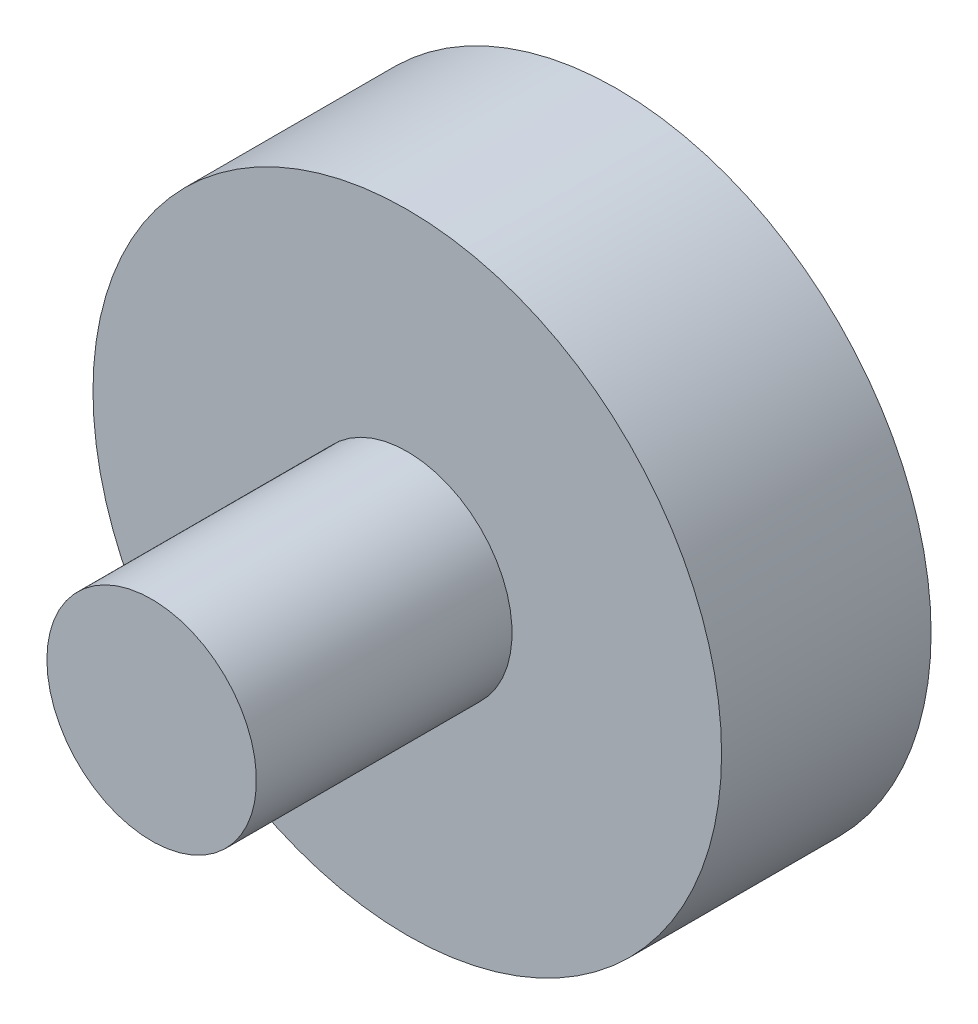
ISO-10303-21;
HEADER;
FILE_DESCRIPTION(('STEP AP214'),'2;1');
FILE_NAME('part.step','',(''),(''),'','','');
FILE_SCHEMA(('AUTOMOTIVE_DESIGN { 1 0 10303 214 1 1 1 1 }'));
ENDSEC;
DATA;
#1=APPLICATION_CONTEXT('core data for automotive mechanical design processes');
#2=APPLICATION_PROTOCOL_DEFINITION('international standard','automotive_design',2000,#1);
#3=PRODUCT_CONTEXT('',#1,'mechanical');
#4=PRODUCT('Part','Part','',(#3));
#5=PRODUCT_RELATED_PRODUCT_CATEGORY('part','',(#4));
#6=PRODUCT_DEFINITION_FORMATION('','',#4);
#7=PRODUCT_DEFINITION_CONTEXT('part definition',#1,'design');
#8=PRODUCT_DEFINITION('design','',#6,#7);
#9=PRODUCT_DEFINITION_SHAPE('','',#8);
#10=(LENGTH_UNIT() NAMED_UNIT(*) SI_UNIT(.MILLI.,.METRE.));
#11=(NAMED_UNIT(*) PLANE_ANGLE_UNIT() SI_UNIT($,.RADIAN.));
#12=(NAMED_UNIT(*) SI_UNIT($,.STERADIAN.) SOLID_ANGLE_UNIT());
#13=UNCERTAINTY_MEASURE_WITH_UNIT(LENGTH_MEASURE(1.E-05),#10,'distance_accuracy_value','');
#14=(GEOMETRIC_REPRESENTATION_CONTEXT(3) GLOBAL_UNCERTAINTY_ASSIGNED_CONTEXT((#13)) GLOBAL_UNIT_ASSIGNED_CONTEXT((#10,
#11,#12)) REPRESENTATION_CONTEXT('',''));
#15=CARTESIAN_POINT('',(0.,0.,0.));
#16=DIRECTION('',(0.,0.,1.));
#17=DIRECTION('',(1.,0.,0.));
#18=AXIS2_PLACEMENT_3D('',#15,#16,#17);
#19=CARTESIAN_POINT('',(0.,0.,50.));
#20=DIRECTION('',(0.,0.,-1.));
#21=DIRECTION('',(-1.,0.,0.));
#22=AXIS2_PLACEMENT_3D('',#19,#20,#21);
#23=CYLINDRICAL_SURFACE('',#22,75.);
#24=CARTESIAN_POINT('',(0.,0.,50.));
#25=DIRECTION('',(0.,0.,1.));
#26=DIRECTION('',(1.,0.,0.));
#27=AXIS2_PLACEMENT_3D('',#24,#25,#26);
#28=CIRCLE('',#27,75.);
#29=CARTESIAN_POINT('',(75.,0.,50.));
#30=VERTEX_POINT('',#29);
#31=EDGE_CURVE('E52',#30,#30,#28,.T.);
#32=ORIENTED_EDGE('',*,*,#31,.F.);
#33=EDGE_LOOP('',(#32));
#34=FACE_BOUND('',#33,.T.);
#35=CARTESIAN_POINT('',(0.,0.,0.));
#36=DIRECTION('',(0.,0.,1.));
#37=DIRECTION('',(1.,0.,0.));
#38=AXIS2_PLACEMENT_3D('',#35,#36,#37);
#39=CIRCLE('',#38,75.);
#40=CARTESIAN_POINT('',(75.,0.,0.));
#41=VERTEX_POINT('',#40);
#42=EDGE_CURVE('E48',#41,#41,#39,.T.);
#43=ORIENTED_EDGE('',*,*,#42,.T.);
#44=EDGE_LOOP('',(#43));
#45=FACE_BOUND('',#44,.T.);
#46=ADVANCED_FACE('F45',(#34,#45),#23,.T.);
#47=CARTESIAN_POINT('',(0.,0.,50.));
#48=DIRECTION('',(0.,0.,1.));
#49=DIRECTION('',(1.,0.,0.));
#50=AXIS2_PLACEMENT_3D('',#47,#48,#49);
#51=PLANE('',#50);
#52=CARTESIAN_POINT('',(0.,0.,50.));
#53=DIRECTION('',(0.,0.,1.));
#54=DIRECTION('',(1.,0.,0.));
#55=AXIS2_PLACEMENT_3D('',#52,#53,#54);
#56=CIRCLE('',#55,25.);
#57=CARTESIAN_POINT('',(-25.,0.,50.));
#58=VERTEX_POINT('',#57);
#59=EDGE_CURVE('E10',#58,#58,#56,.T.);
#60=ORIENTED_EDGE('',*,*,#59,.F.);
#61=EDGE_LOOP('',(#60));
#62=FACE_BOUND('',#61,.T.);
#63=ORIENTED_EDGE('',*,*,#31,.T.);
#64=EDGE_LOOP('',(#63));
#65=FACE_BOUND('',#64,.T.);
#66=ADVANCED_FACE('F69',(#62,#65),#51,.T.);
#67=CARTESIAN_POINT('',(0.,0.,0.));
#68=DIRECTION('',(0.,0.,1.));
#69=DIRECTION('',(1.,0.,0.));
#70=AXIS2_PLACEMENT_3D('',#67,#68,#69);
#71=PLANE('',#70);
#72=ORIENTED_EDGE('',*,*,#42,.F.);
#73=EDGE_LOOP('',(#72));
#74=FACE_BOUND('',#73,.T.);
#75=ADVANCED_FACE('F66',(#74),#71,.F.);
#76=CARTESIAN_POINT('',(0.,0.,111.));
#77=DIRECTION('',(0.,0.,-1.));
#78=DIRECTION('',(-1.,0.,0.));
#79=AXIS2_PLACEMENT_3D('',#76,#77,#78);
#80=CYLINDRICAL_SURFACE('',#79,25.);
#81=CARTESIAN_POINT('',(0.,0.,111.));
#82=DIRECTION('',(0.,0.,1.));
#83=DIRECTION('',(1.,0.,0.));
#84=AXIS2_PLACEMENT_3D('',#81,#82,#83);
#85=CIRCLE('',#84,25.);
#86=CARTESIAN_POINT('',(-25.,0.,111.));
#87=VERTEX_POINT('',#86);
#88=EDGE_CURVE('E58',#87,#87,#85,.T.);
#89=CARTESIAN_POINT('',(-25.,0.,111.));
#90=CARTESIAN_POINT('',(-25.,0.,110.364583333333));
#91=CARTESIAN_POINT('',(-25.,0.,109.729166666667));
#92=CARTESIAN_POINT('',(-25.,0.,108.458333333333));
#93=CARTESIAN_POINT('',(-25.,0.,107.822916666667));
#94=CARTESIAN_POINT('',(-25.,0.,106.552083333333));
#95=CARTESIAN_POINT('',(-25.,0.,105.916666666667));
#96=CARTESIAN_POINT('',(-25.,0.,104.645833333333));
#97=CARTESIAN_POINT('',(-25.,0.,104.010416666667));
#98=CARTESIAN_POINT('',(-25.,0.,102.739583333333));
#99=CARTESIAN_POINT('',(-25.,0.,102.104166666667));
#100=CARTESIAN_POINT('',(-25.,0.,100.833333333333));
#101=CARTESIAN_POINT('',(-25.,0.,100.197916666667));
#102=CARTESIAN_POINT('',(-25.,0.,98.9270833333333));
#103=CARTESIAN_POINT('',(-25.,0.,98.2916666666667));
#104=CARTESIAN_POINT('',(-25.,0.,97.0208333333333));
#105=CARTESIAN_POINT('',(-25.,0.,96.3854166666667));
#106=CARTESIAN_POINT('',(-25.,0.,95.1145833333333));
#107=CARTESIAN_POINT('',(-25.,0.,94.4791666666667));
#108=CARTESIAN_POINT('',(-25.,0.,93.2083333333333));
#109=CARTESIAN_POINT('',(-25.,0.,92.5729166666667));
#110=CARTESIAN_POINT('',(-25.,0.,91.3020833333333));
#111=CARTESIAN_POINT('',(-25.,0.,90.6666666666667));
#112=CARTESIAN_POINT('',(-25.,0.,89.3958333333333));
#113=CARTESIAN_POINT('',(-25.,0.,88.7604166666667));
#114=CARTESIAN_POINT('',(-25.,0.,87.4895833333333));
#115=CARTESIAN_POINT('',(-25.,0.,86.8541666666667));
#116=CARTESIAN_POINT('',(-25.,0.,85.5833333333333));
#117=CARTESIAN_POINT('',(-25.,0.,84.9479166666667));
#118=CARTESIAN_POINT('',(-25.,0.,83.6770833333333));
#119=CARTESIAN_POINT('',(-25.,0.,83.0416666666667));
#120=CARTESIAN_POINT('',(-25.,0.,81.7708333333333));
#121=CARTESIAN_POINT('',(-25.,0.,81.1354166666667));
#122=CARTESIAN_POINT('',(-25.,0.,79.8645833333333));
#123=CARTESIAN_POINT('',(-25.,0.,79.2291666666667));
#124=CARTESIAN_POINT('',(-25.,0.,77.9583333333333));
#125=CARTESIAN_POINT('',(-25.,0.,77.3229166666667));
#126=CARTESIAN_POINT('',(-25.,0.,76.0520833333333));
#127=CARTESIAN_POINT('',(-25.,0.,75.4166666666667));
#128=CARTESIAN_POINT('',(-25.,0.,74.1458333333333));
#129=CARTESIAN_POINT('',(-25.,0.,73.5104166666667));
#130=CARTESIAN_POINT('',(-25.,0.,72.2395833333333));
#131=CARTESIAN_POINT('',(-25.,0.,71.6041666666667));
#132=CARTESIAN_POINT('',(-25.,0.,70.3333333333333));
#133=CARTESIAN_POINT('',(-25.,0.,69.6979166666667));
#134=CARTESIAN_POINT('',(-25.,0.,68.4270833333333));
#135=CARTESIAN_POINT('',(-25.,0.,67.7916666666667));
#136=CARTESIAN_POINT('',(-25.,0.,66.5208333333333));
#137=CARTESIAN_POINT('',(-25.,0.,65.8854166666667));
#138=CARTESIAN_POINT('',(-25.,0.,64.6145833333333));
#139=CARTESIAN_POINT('',(-25.,0.,63.9791666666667));
#140=CARTESIAN_POINT('',(-25.,0.,62.7083333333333));
#141=CARTESIAN_POINT('',(-25.,0.,62.0729166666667));
#142=CARTESIAN_POINT('',(-25.,0.,60.8020833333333));
#143=CARTESIAN_POINT('',(-25.,0.,60.1666666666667));
#144=CARTESIAN_POINT('',(-25.,0.,58.8958333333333));
#145=CARTESIAN_POINT('',(-25.,0.,58.2604166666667));
#146=CARTESIAN_POINT('',(-25.,0.,56.9895833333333));
#147=CARTESIAN_POINT('',(-25.,0.,56.3541666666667));
#148=CARTESIAN_POINT('',(-25.,0.,55.0833333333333));
#149=CARTESIAN_POINT('',(-25.,0.,54.4479166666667));
#150=CARTESIAN_POINT('',(-25.,0.,53.1770833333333));
#151=CARTESIAN_POINT('',(-25.,0.,52.5416666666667));
#152=CARTESIAN_POINT('',(-25.,0.,51.2708333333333));
#153=CARTESIAN_POINT('',(-25.,0.,50.6354166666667));
#154=CARTESIAN_POINT('',(-25.,0.,50.));
#155=B_SPLINE_CURVE_WITH_KNOTS('',3,(#89,#90,#91,#92,#93,#94,#95,#96,#97,#98,#99,#100,#101,#102,
#103,#104,#105,#106,#107,#108,#109,#110,#111,#112,#113,#114,#115,#116,#117,#118,#119,#120,#121,
#122,#123,#124,#125,#126,#127,#128,#129,#130,#131,#132,#133,#134,#135,#136,#137,#138,#139,#140,
#141,#142,#143,#144,#145,#146,#147,#148,#149,#150,#151,#152,#153,#154),.UNSPECIFIED.,.F.,.F.,(4,
2,2,2,2,2,2,2,2,2,2,2,2,2,2,2,2,2,2,2,2,2,2,2,2,2,2,2,2,2,2,2,4),(0.,1.90625,3.8125,
5.71874999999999,7.62499999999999,9.53124999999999,11.4375,13.34375,15.25,17.15625,19.0625,
20.96875,22.875,24.78125,26.6875,28.59375,30.5,32.40625,34.3125,36.21875,38.125,40.03125,
41.9375,43.84375,45.75,47.65625,49.5625,51.46875,53.375,55.28125,57.1875,59.09375,61.),.UNSPECIFIED.);
#156=EDGE_CURVE('BSEAM68',#87,#58,#155,.T.);
#157=ORIENTED_EDGE('',*,*,#88,.F.);
#158=ORIENTED_EDGE('',*,*,#59,.T.);
#159=ORIENTED_EDGE('',*,*,#156,.T.);
#160=ORIENTED_EDGE('',*,*,#156,.F.);
#161=EDGE_LOOP('',(#157,#159,#158,#160));
#162=FACE_BOUND('',#161,.T.);
#163=ADVANCED_FACE('F68',(#162),#80,.T.);
#164=CARTESIAN_POINT('',(0.,0.,111.));
#165=DIRECTION('',(0.,0.,1.));
#166=DIRECTION('',(1.,0.,0.));
#167=AXIS2_PLACEMENT_3D('',#164,#165,#166);
#168=PLANE('',#167);
#169=ORIENTED_EDGE('',*,*,#88,.T.);
#170=EDGE_LOOP('',(#169));
#171=FACE_BOUND('',#170,.T.);
#172=ADVANCED_FACE('F75',(#171),#168,.T.);
#173=CLOSED_SHELL('',(#46,#66,#75,#163,#172));
#174=MANIFOLD_SOLID_BREP('B2',#173);
#175=ADVANCED_BREP_SHAPE_REPRESENTATION('',(#18,#174),#14);
#176=SHAPE_DEFINITION_REPRESENTATION(#9,#175);
ENDSEC;
END-ISO-10303-21;
